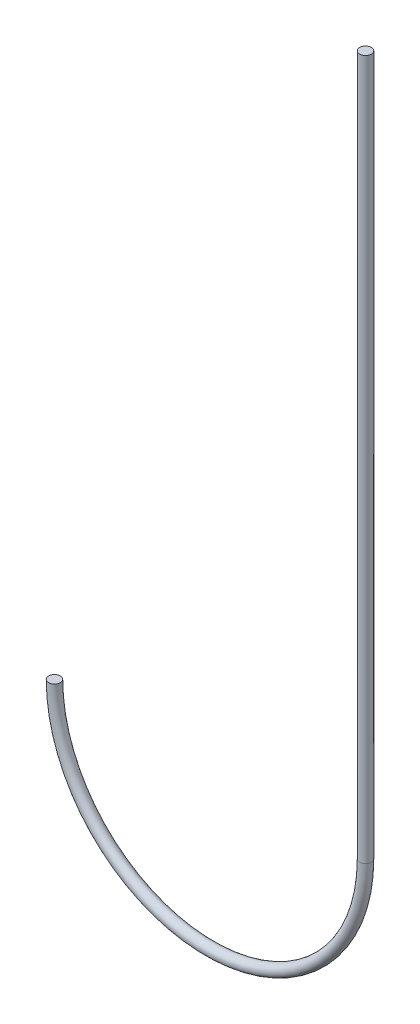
ISO-10303-21;
HEADER;
FILE_DESCRIPTION(('STEP AP214'),'2;1');
FILE_NAME('part.step','',(''),(''),'','','');
FILE_SCHEMA(('AUTOMOTIVE_DESIGN { 1 0 10303 214 1 1 1 1 }'));
ENDSEC;
DATA;
#1=APPLICATION_CONTEXT('core data for automotive mechanical design processes');
#2=APPLICATION_PROTOCOL_DEFINITION('international standard','automotive_design',2000,#1);
#3=PRODUCT_CONTEXT('',#1,'mechanical');
#4=PRODUCT('Part','Part','',(#3));
#5=PRODUCT_RELATED_PRODUCT_CATEGORY('part','',(#4));
#6=PRODUCT_DEFINITION_FORMATION('','',#4);
#7=PRODUCT_DEFINITION_CONTEXT('part definition',#1,'design');
#8=PRODUCT_DEFINITION('design','',#6,#7);
#9=PRODUCT_DEFINITION_SHAPE('','',#8);
#10=(LENGTH_UNIT() NAMED_UNIT(*) SI_UNIT(.MILLI.,.METRE.));
#11=(NAMED_UNIT(*) PLANE_ANGLE_UNIT() SI_UNIT($,.RADIAN.));
#12=(NAMED_UNIT(*) SI_UNIT($,.STERADIAN.) SOLID_ANGLE_UNIT());
#13=UNCERTAINTY_MEASURE_WITH_UNIT(LENGTH_MEASURE(1.E-05),#10,'distance_accuracy_value','');
#14=(GEOMETRIC_REPRESENTATION_CONTEXT(3) GLOBAL_UNCERTAINTY_ASSIGNED_CONTEXT((#13)) GLOBAL_UNIT_ASSIGNED_CONTEXT((#10,
#11,#12)) REPRESENTATION_CONTEXT('',''));
#15=CARTESIAN_POINT('',(0.,0.,0.));
#16=DIRECTION('',(0.,0.,1.));
#17=DIRECTION('',(1.,0.,0.));
#18=AXIS2_PLACEMENT_3D('',#15,#16,#17);
#19=CARTESIAN_POINT('',(0.,0.,0.));
#20=DIRECTION('',(0.,0.,1.));
#21=DIRECTION('',(1.,0.,0.));
#22=AXIS2_PLACEMENT_3D('',#19,#20,#21);
#23=TOROIDAL_SURFACE('',#22,20.,0.750000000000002);
#24=CARTESIAN_POINT('',(-20.,2.81767881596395E-13,0.));
#25=DIRECTION('',(0.,-1.,0.));
#26=DIRECTION('',(0.,0.,1.));
#27=AXIS2_PLACEMENT_3D('',#24,#25,#26);
#28=CIRCLE('',#27,0.750000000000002);
#29=CARTESIAN_POINT('',(-20.75,2.9233417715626E-13,0.));
#30=VERTEX_POINT('',#29);
#31=EDGE_CURVE('E10',#30,#30,#28,.T.);
#32=CARTESIAN_POINT('',(20.,0.,0.));
#33=DIRECTION('',(0.,1.,0.));
#34=DIRECTION('',(0.,0.,1.));
#35=AXIS2_PLACEMENT_3D('',#32,#33,#34);
#36=CIRCLE('',#35,0.750000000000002);
#37=CARTESIAN_POINT('',(20.75,0.,0.));
#38=VERTEX_POINT('',#37);
#39=EDGE_CURVE('E37',#38,#38,#36,.T.);
#40=CARTESIAN_POINT('',(0.,0.,0.));
#41=DIRECTION('',(0.,0.,1.));
#42=DIRECTION('',(1.,0.,0.));
#43=AXIS2_PLACEMENT_3D('',#40,#41,#42);
#44=CIRCLE('',#43,20.75);
#45=EDGE_CURVE('',#30,#38,#44,.T.);
#46=ORIENTED_EDGE('',*,*,#31,.T.);
#47=ORIENTED_EDGE('',*,*,#39,.F.);
#48=ORIENTED_EDGE('',*,*,#45,.T.);
#49=ORIENTED_EDGE('',*,*,#45,.F.);
#50=EDGE_LOOP('',(#46,#48,#47,#49));
#51=FACE_BOUND('',#50,.T.);
#52=ADVANCED_FACE('F31',(#51),#23,.T.);
#53=CARTESIAN_POINT('',(-20.,2.81767881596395E-13,0.));
#54=DIRECTION('',(0.,-1.,0.));
#55=DIRECTION('',(0.,0.,1.));
#56=AXIS2_PLACEMENT_3D('',#53,#54,#55);
#57=PLANE('',#56);
#58=ORIENTED_EDGE('',*,*,#31,.F.);
#59=EDGE_LOOP('',(#58));
#60=FACE_BOUND('',#59,.T.);
#61=ADVANCED_FACE('F52',(#60),#57,.F.);
#62=CARTESIAN_POINT('',(20.,90.,0.));
#63=DIRECTION('',(0.,-1.,0.));
#64=DIRECTION('',(0.,0.,-1.));
#65=AXIS2_PLACEMENT_3D('',#62,#63,#64);
#66=CYLINDRICAL_SURFACE('',#65,0.750000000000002);
#67=CARTESIAN_POINT('',(20.,90.,0.));
#68=DIRECTION('',(0.,1.,0.));
#69=DIRECTION('',(0.,0.,1.));
#70=AXIS2_PLACEMENT_3D('',#67,#68,#69);
#71=CIRCLE('',#70,0.750000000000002);
#72=CARTESIAN_POINT('',(20.,90.,0.750000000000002));
#73=VERTEX_POINT('',#72);
#74=EDGE_CURVE('E41',#73,#73,#71,.T.);
#75=ORIENTED_EDGE('',*,*,#74,.F.);
#76=EDGE_LOOP('',(#75));
#77=FACE_BOUND('',#76,.T.);
#78=ORIENTED_EDGE('',*,*,#39,.T.);
#79=EDGE_LOOP('',(#78));
#80=FACE_BOUND('',#79,.T.);
#81=ADVANCED_FACE('F50',(#77,#80),#66,.T.);
#82=CARTESIAN_POINT('',(20.,90.,0.));
#83=DIRECTION('',(0.,1.,0.));
#84=DIRECTION('',(0.,0.,1.));
#85=AXIS2_PLACEMENT_3D('',#82,#83,#84);
#86=PLANE('',#85);
#87=ORIENTED_EDGE('',*,*,#74,.T.);
#88=EDGE_LOOP('',(#87));
#89=FACE_BOUND('',#88,.T.);
#90=ADVANCED_FACE('F48',(#89),#86,.T.);
#91=CLOSED_SHELL('',(#52,#61,#81,#90));
#92=MANIFOLD_SOLID_BREP('B2',#91);
#93=ADVANCED_BREP_SHAPE_REPRESENTATION('',(#18,#92),#14);
#94=SHAPE_DEFINITION_REPRESENTATION(#9,#93);
ENDSEC;
END-ISO-10303-21;
